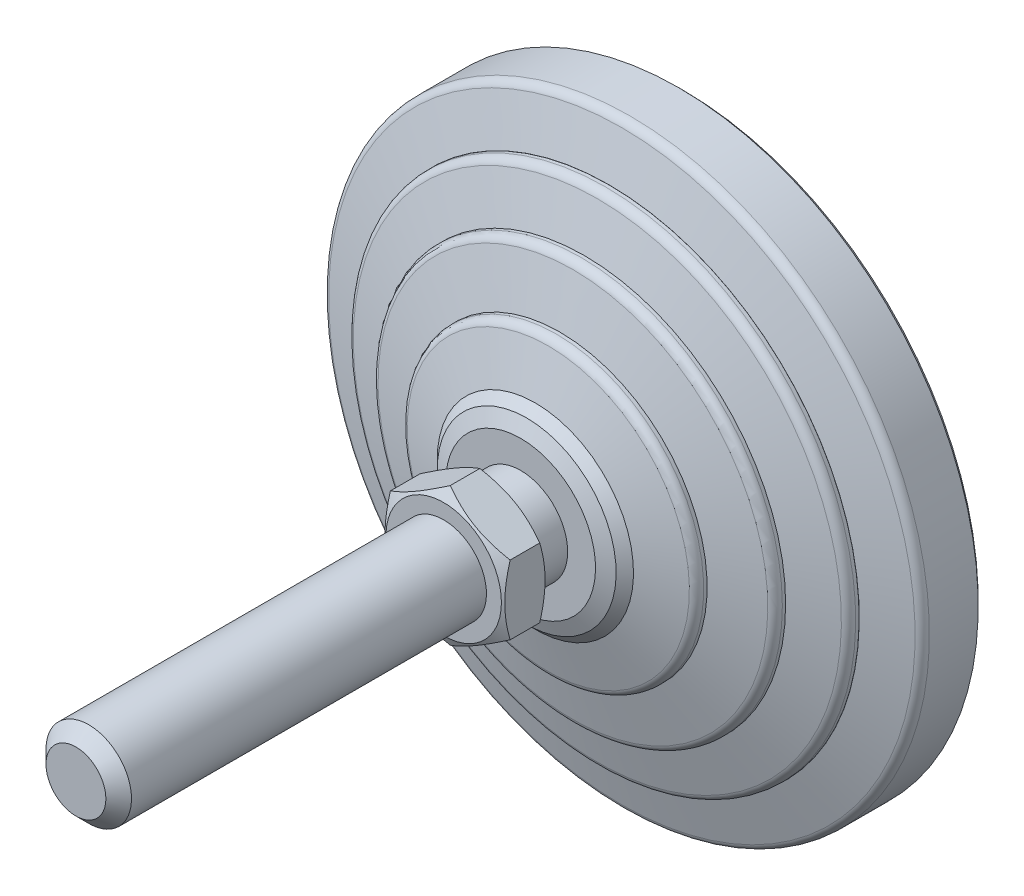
ISO-10303-21;
HEADER;
FILE_DESCRIPTION(('STEP AP214'),'2;1');
FILE_NAME('part.step','',(''),(''),'','','');
FILE_SCHEMA(('AUTOMOTIVE_DESIGN { 1 0 10303 214 1 1 1 1 }'));
ENDSEC;
DATA;
#1=APPLICATION_CONTEXT('core data for automotive mechanical design processes');
#2=APPLICATION_PROTOCOL_DEFINITION('international standard','automotive_design',2000,#1);
#3=PRODUCT_CONTEXT('',#1,'mechanical');
#4=PRODUCT('Part','Part','',(#3));
#5=PRODUCT_RELATED_PRODUCT_CATEGORY('part','',(#4));
#6=PRODUCT_DEFINITION_FORMATION('','',#4);
#7=PRODUCT_DEFINITION_CONTEXT('part definition',#1,'design');
#8=PRODUCT_DEFINITION('design','',#6,#7);
#9=PRODUCT_DEFINITION_SHAPE('','',#8);
#10=(LENGTH_UNIT() NAMED_UNIT(*) SI_UNIT(.MILLI.,.METRE.));
#11=(NAMED_UNIT(*) PLANE_ANGLE_UNIT() SI_UNIT($,.RADIAN.));
#12=(NAMED_UNIT(*) SI_UNIT($,.STERADIAN.) SOLID_ANGLE_UNIT());
#13=UNCERTAINTY_MEASURE_WITH_UNIT(LENGTH_MEASURE(1.E-05),#10,'distance_accuracy_value','');
#14=(GEOMETRIC_REPRESENTATION_CONTEXT(3) GLOBAL_UNCERTAINTY_ASSIGNED_CONTEXT((#13)) GLOBAL_UNIT_ASSIGNED_CONTEXT((#10,
#11,#12)) REPRESENTATION_CONTEXT('',''));
#15=CARTESIAN_POINT('',(0.,0.,0.));
#16=DIRECTION('',(0.,0.,1.));
#17=DIRECTION('',(1.,0.,0.));
#18=AXIS2_PLACEMENT_3D('',#15,#16,#17);
#19=CARTESIAN_POINT('',(-5.5,0.,23.));
#20=DIRECTION('',(0.,0.,1.));
#21=DIRECTION('',(0.,-1.,0.));
#22=AXIS2_PLACEMENT_3D('',#19,#20,#21);
#23=PLANE('',#22);
#24=CARTESIAN_POINT('',(0.,0.,22.9999999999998));
#25=DIRECTION('',(0.,0.,1.));
#26=DIRECTION('',(1.,0.,0.));
#27=AXIS2_PLACEMENT_3D('',#24,#25,#26);
#28=CIRCLE('',#27,6.75);
#29=CARTESIAN_POINT('',(6.75,0.,22.9999999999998));
#30=VERTEX_POINT('',#29);
#31=EDGE_CURVE('E317',#30,#30,#28,.T.);
#32=ORIENTED_EDGE('',*,*,#31,.F.);
#33=EDGE_LOOP('',(#32));
#34=FACE_BOUND('',#33,.T.);
#35=CARTESIAN_POINT('',(0.,0.,23.));
#36=DIRECTION('',(0.,0.,-1.));
#37=DIRECTION('',(0.,1.,0.));
#38=AXIS2_PLACEMENT_3D('',#35,#36,#37);
#39=CIRCLE('',#38,5.5);
#40=CARTESIAN_POINT('',(0.,5.5,23.));
#41=VERTEX_POINT('',#40);
#42=EDGE_CURVE('E156',#41,#41,#39,.T.);
#43=ORIENTED_EDGE('',*,*,#42,.F.);
#44=EDGE_LOOP('',(#43));
#45=FACE_BOUND('',#44,.T.);
#46=ADVANCED_FACE('F14',(#34,#45),#23,.F.);
#47=CARTESIAN_POINT('',(0.,0.,0.));
#48=DIRECTION('',(0.,0.,-1.));
#49=DIRECTION('',(0.,1.,0.));
#50=AXIS2_PLACEMENT_3D('',#47,#48,#49);
#51=CYLINDRICAL_SURFACE('',#50,5.5);
#52=CARTESIAN_POINT('',(0.,0.,19.));
#53=DIRECTION('',(0.,0.,-1.));
#54=DIRECTION('',(0.,1.,0.));
#55=AXIS2_PLACEMENT_3D('',#52,#53,#54);
#56=CIRCLE('',#55,5.5);
#57=CARTESIAN_POINT('',(0.,5.5,19.));
#58=VERTEX_POINT('',#57);
#59=EDGE_CURVE('E153',#58,#58,#56,.T.);
#60=ORIENTED_EDGE('',*,*,#59,.F.);
#61=EDGE_LOOP('',(#60));
#62=FACE_BOUND('',#61,.T.);
#63=ORIENTED_EDGE('',*,*,#42,.T.);
#64=EDGE_LOOP('',(#63));
#65=FACE_BOUND('',#64,.T.);
#66=ADVANCED_FACE('F184',(#62,#65),#51,.T.);
#67=CARTESIAN_POINT('',(-8.75409836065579,0.,19.));
#68=DIRECTION('',(0.,0.,-1.));
#69=DIRECTION('',(0.,1.,0.));
#70=AXIS2_PLACEMENT_3D('',#67,#68,#69);
#71=PLANE('',#70);
#72=CARTESIAN_POINT('',(0.,0.,19.));
#73=DIRECTION('',(0.,0.,-1.));
#74=DIRECTION('',(0.,1.,0.));
#75=AXIS2_PLACEMENT_3D('',#72,#73,#74);
#76=CIRCLE('',#75,8.75409836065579);
#77=CARTESIAN_POINT('',(0.,8.75409836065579,19.));
#78=VERTEX_POINT('',#77);
#79=EDGE_CURVE('E150',#78,#78,#76,.T.);
#80=ORIENTED_EDGE('',*,*,#79,.F.);
#81=EDGE_LOOP('',(#80));
#82=FACE_BOUND('',#81,.T.);
#83=ORIENTED_EDGE('',*,*,#59,.T.);
#84=EDGE_LOOP('',(#83));
#85=FACE_BOUND('',#84,.T.);
#86=ADVANCED_FACE('F191',(#82,#85),#71,.F.);
#87=CARTESIAN_POINT('',(0.,0.,19.));
#88=DIRECTION('',(0.,0.,-1.));
#89=DIRECTION('',(0.,1.,0.));
#90=AXIS2_PLACEMENT_3D('',#87,#88,#89);
#91=CONICAL_SURFACE('',#90,8.75409836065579,1.17809724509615);
#92=CARTESIAN_POINT('',(0.,0.,18.2928932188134));
#93=DIRECTION('',(0.,0.,-1.));
#94=DIRECTION('',(0.,1.,0.));
#95=AXIS2_PLACEMENT_3D('',#92,#93,#94);
#96=CIRCLE('',#95,10.4612051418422);
#97=CARTESIAN_POINT('',(0.,10.4612051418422,18.2928932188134));
#98=VERTEX_POINT('',#97);
#99=EDGE_CURVE('E147',#98,#98,#96,.T.);
#100=ORIENTED_EDGE('',*,*,#99,.F.);
#101=EDGE_LOOP('',(#100));
#102=FACE_BOUND('',#101,.T.);
#103=ORIENTED_EDGE('',*,*,#79,.T.);
#104=EDGE_LOOP('',(#103));
#105=FACE_BOUND('',#104,.T.);
#106=ADVANCED_FACE('F548',(#102,#105),#91,.T.);
#107=CARTESIAN_POINT('',(0.,0.,18.2928932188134));
#108=DIRECTION('',(0.,0.,-1.));
#109=DIRECTION('',(0.,1.,0.));
#110=AXIS2_PLACEMENT_3D('',#107,#108,#109);
#111=CONICAL_SURFACE('',#110,10.4612051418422,0.785398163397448);
#112=CARTESIAN_POINT('',(0.,0.,17.2786885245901));
#113=DIRECTION('',(0.,0.,-1.));
#114=DIRECTION('',(0.,1.,0.));
#115=AXIS2_PLACEMENT_3D('',#112,#113,#114);
#116=CIRCLE('',#115,11.4754098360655);
#117=CARTESIAN_POINT('',(0.,11.4754098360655,17.2786885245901));
#118=VERTEX_POINT('',#117);
#119=EDGE_CURVE('E144',#118,#118,#116,.T.);
#120=ORIENTED_EDGE('',*,*,#119,.F.);
#121=EDGE_LOOP('',(#120));
#122=FACE_BOUND('',#121,.T.);
#123=ORIENTED_EDGE('',*,*,#99,.T.);
#124=EDGE_LOOP('',(#123));
#125=FACE_BOUND('',#124,.T.);
#126=ADVANCED_FACE('F539',(#122,#125),#111,.T.);
#127=CARTESIAN_POINT('',(0.,0.,17.2786885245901));
#128=DIRECTION('',(0.,0.,-1.));
#129=DIRECTION('',(0.,1.,0.));
#130=AXIS2_PLACEMENT_3D('',#127,#128,#129);
#131=CONICAL_SURFACE('',#130,11.4754098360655,1.27933953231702);
#132=CARTESIAN_POINT('',(0.,0.,15.7711726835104));
#133=DIRECTION('',(0.,0.,-1.));
#134=DIRECTION('',(0.,1.,0.));
#135=AXIS2_PLACEMENT_3D('',#132,#133,#134);
#136=CIRCLE('',#135,16.5004626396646);
#137=CARTESIAN_POINT('',(0.,16.5004626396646,15.7711726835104));
#138=VERTEX_POINT('',#137);
#139=EDGE_CURVE('E141',#138,#138,#136,.T.);
#140=ORIENTED_EDGE('',*,*,#139,.F.);
#141=EDGE_LOOP('',(#140));
#142=FACE_BOUND('',#141,.T.);
#143=ORIENTED_EDGE('',*,*,#119,.T.);
#144=EDGE_LOOP('',(#143));
#145=FACE_BOUND('',#144,.T.);
#146=ADVANCED_FACE('F530',(#142,#145),#131,.T.);
#147=CARTESIAN_POINT('',(0.,0.,14.8133463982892));
#148=DIRECTION('',(0.,0.,-1.));
#149=DIRECTION('',(0.,1.,0.));
#150=AXIS2_PLACEMENT_3D('',#147,#148,#149);
#151=TOROIDAL_SURFACE('',#150,16.2131147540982,1.);
#152=CARTESIAN_POINT('',(0.,0.,14.8133463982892));
#153=DIRECTION('',(0.,0.,-1.));
#154=DIRECTION('',(0.,1.,0.));
#155=AXIS2_PLACEMENT_3D('',#152,#153,#154);
#156=CIRCLE('',#155,17.2131147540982);
#157=CARTESIAN_POINT('',(0.,17.2131147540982,14.8133463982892));
#158=VERTEX_POINT('',#157);
#159=EDGE_CURVE('E138',#158,#158,#156,.T.);
#160=ORIENTED_EDGE('',*,*,#159,.F.);
#161=EDGE_LOOP('',(#160));
#162=FACE_BOUND('',#161,.T.);
#163=ORIENTED_EDGE('',*,*,#139,.T.);
#164=EDGE_LOOP('',(#163));
#165=FACE_BOUND('',#164,.T.);
#166=ADVANCED_FACE('F521',(#162,#165),#151,.T.);
#167=CARTESIAN_POINT('',(0.,0.,0.));
#168=DIRECTION('',(0.,0.,-1.));
#169=DIRECTION('',(0.,1.,0.));
#170=AXIS2_PLACEMENT_3D('',#167,#168,#169);
#171=CYLINDRICAL_SURFACE('',#170,17.2131147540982);
#172=CARTESIAN_POINT('',(0.,0.,14.4098360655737));
#173=DIRECTION('',(0.,0.,-1.));
#174=DIRECTION('',(0.,1.,0.));
#175=AXIS2_PLACEMENT_3D('',#172,#173,#174);
#176=CIRCLE('',#175,17.2131147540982);
#177=CARTESIAN_POINT('',(0.,17.2131147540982,14.4098360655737));
#178=VERTEX_POINT('',#177);
#179=EDGE_CURVE('E135',#178,#178,#176,.T.);
#180=ORIENTED_EDGE('',*,*,#179,.F.);
#181=EDGE_LOOP('',(#180));
#182=FACE_BOUND('',#181,.T.);
#183=ORIENTED_EDGE('',*,*,#159,.T.);
#184=EDGE_LOOP('',(#183));
#185=FACE_BOUND('',#184,.T.);
#186=ADVANCED_FACE('F512',(#182,#185),#171,.T.);
#187=CARTESIAN_POINT('',(0.,0.,14.4098360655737));
#188=DIRECTION('',(0.,0.,-1.));
#189=DIRECTION('',(0.,1.,0.));
#190=AXIS2_PLACEMENT_3D('',#187,#188,#189);
#191=CONICAL_SURFACE('',#190,17.2131147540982,1.30454427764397);
#192=CARTESIAN_POINT('',(0.,0.,12.8894925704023));
#193=DIRECTION('',(0.,0.,-1.));
#194=DIRECTION('',(0.,1.,0.));
#195=AXIS2_PLACEMENT_3D('',#192,#193,#194);
#196=CIRCLE('',#195,22.7877075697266);
#197=CARTESIAN_POINT('',(0.,22.7877075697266,12.8894925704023));
#198=VERTEX_POINT('',#197);
#199=EDGE_CURVE('E132',#198,#198,#196,.T.);
#200=ORIENTED_EDGE('',*,*,#199,.F.);
#201=EDGE_LOOP('',(#200));
#202=FACE_BOUND('',#201,.T.);
#203=ORIENTED_EDGE('',*,*,#179,.T.);
#204=EDGE_LOOP('',(#203));
#205=FACE_BOUND('',#204,.T.);
#206=ADVANCED_FACE('F503',(#202,#205),#191,.T.);
#207=CARTESIAN_POINT('',(0.,0.,11.9247287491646));
#208=DIRECTION('',(0.,0.,-1.));
#209=DIRECTION('',(0.,1.,0.));
#210=AXIS2_PLACEMENT_3D('',#207,#208,#209);
#211=TOROIDAL_SURFACE('',#210,22.5245901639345,1.);
#212=CARTESIAN_POINT('',(0.,0.,11.9247287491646));
#213=DIRECTION('',(0.,0.,-1.));
#214=DIRECTION('',(0.,1.,0.));
#215=AXIS2_PLACEMENT_3D('',#212,#213,#214);
#216=CIRCLE('',#215,23.5245901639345);
#217=CARTESIAN_POINT('',(0.,23.5245901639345,11.9247287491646));
#218=VERTEX_POINT('',#217);
#219=EDGE_CURVE('E129',#218,#218,#216,.T.);
#220=ORIENTED_EDGE('',*,*,#219,.F.);
#221=EDGE_LOOP('',(#220));
#222=FACE_BOUND('',#221,.T.);
#223=ORIENTED_EDGE('',*,*,#199,.T.);
#224=EDGE_LOOP('',(#223));
#225=FACE_BOUND('',#224,.T.);
#226=ADVANCED_FACE('F494',(#222,#225),#211,.T.);
#227=CARTESIAN_POINT('',(0.,0.,0.));
#228=DIRECTION('',(0.,0.,-1.));
#229=DIRECTION('',(0.,1.,0.));
#230=AXIS2_PLACEMENT_3D('',#227,#228,#229);
#231=CYLINDRICAL_SURFACE('',#230,23.5245901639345);
#232=CARTESIAN_POINT('',(0.,0.,11.5409836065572));
#233=DIRECTION('',(0.,0.,-1.));
#234=DIRECTION('',(0.,1.,0.));
#235=AXIS2_PLACEMENT_3D('',#232,#233,#234);
#236=CIRCLE('',#235,23.5245901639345);
#237=CARTESIAN_POINT('',(0.,23.5245901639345,11.5409836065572));
#238=VERTEX_POINT('',#237);
#239=EDGE_CURVE('E126',#238,#238,#236,.T.);
#240=ORIENTED_EDGE('',*,*,#239,.F.);
#241=EDGE_LOOP('',(#240));
#242=FACE_BOUND('',#241,.T.);
#243=ORIENTED_EDGE('',*,*,#219,.T.);
#244=EDGE_LOOP('',(#243));
#245=FACE_BOUND('',#244,.T.);
#246=ADVANCED_FACE('F485',(#242,#245),#231,.T.);
#247=CARTESIAN_POINT('',(0.,0.,11.5409836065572));
#248=DIRECTION('',(0.,0.,-1.));
#249=DIRECTION('',(0.,1.,0.));
#250=AXIS2_PLACEMENT_3D('',#247,#248,#249);
#251=CONICAL_SURFACE('',#250,23.5245901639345,1.2787125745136);
#252=CARTESIAN_POINT('',(0.,0.,10.0337743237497));
#253=DIRECTION('',(0.,0.,-1.));
#254=DIRECTION('',(0.,1.,0.));
#255=AXIS2_PLACEMENT_3D('',#252,#253,#254);
#256=CIRCLE('',#255,28.5372004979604);
#257=CARTESIAN_POINT('',(0.,28.5372004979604,10.0337743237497));
#258=VERTEX_POINT('',#257);
#259=EDGE_CURVE('E123',#258,#258,#256,.T.);
#260=ORIENTED_EDGE('',*,*,#259,.F.);
#261=EDGE_LOOP('',(#260));
#262=FACE_BOUND('',#261,.T.);
#263=ORIENTED_EDGE('',*,*,#239,.T.);
#264=EDGE_LOOP('',(#263));
#265=FACE_BOUND('',#264,.T.);
#266=ADVANCED_FACE('F476',(#262,#265),#251,.T.);
#267=CARTESIAN_POINT('',(0.,0.,9.07612838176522));
#268=DIRECTION('',(0.,0.,-1.));
#269=DIRECTION('',(0.,1.,0.));
#270=AXIS2_PLACEMENT_3D('',#267,#268,#269);
#271=TOROIDAL_SURFACE('',#270,28.2492521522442,1.);
#272=CARTESIAN_POINT('',(0.,0.,9.07612838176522));
#273=DIRECTION('',(0.,0.,-1.));
#274=DIRECTION('',(0.,1.,0.));
#275=AXIS2_PLACEMENT_3D('',#272,#273,#274);
#276=CIRCLE('',#275,29.2492521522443);
#277=CARTESIAN_POINT('',(0.,29.2492521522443,9.07612838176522));
#278=VERTEX_POINT('',#277);
#279=EDGE_CURVE('E120',#278,#278,#276,.T.);
#280=ORIENTED_EDGE('',*,*,#279,.F.);
#281=EDGE_LOOP('',(#280));
#282=FACE_BOUND('',#281,.T.);
#283=ORIENTED_EDGE('',*,*,#259,.T.);
#284=EDGE_LOOP('',(#283));
#285=FACE_BOUND('',#284,.T.);
#286=ADVANCED_FACE('F467',(#282,#285),#271,.T.);
#287=CARTESIAN_POINT('',(0.,0.,0.));
#288=DIRECTION('',(0.,0.,-1.));
#289=DIRECTION('',(0.,1.,0.));
#290=AXIS2_PLACEMENT_3D('',#287,#288,#289);
#291=CYLINDRICAL_SURFACE('',#290,29.2492521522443);
#292=CARTESIAN_POINT('',(0.,0.,8.67213114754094));
#293=DIRECTION('',(0.,0.,-1.));
#294=DIRECTION('',(0.,1.,0.));
#295=AXIS2_PLACEMENT_3D('',#292,#293,#294);
#296=CIRCLE('',#295,29.2492521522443);
#297=CARTESIAN_POINT('',(0.,29.2492521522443,8.67213114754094));
#298=VERTEX_POINT('',#297);
#299=EDGE_CURVE('E117',#298,#298,#296,.T.);
#300=ORIENTED_EDGE('',*,*,#299,.F.);
#301=EDGE_LOOP('',(#300));
#302=FACE_BOUND('',#301,.T.);
#303=ORIENTED_EDGE('',*,*,#279,.T.);
#304=EDGE_LOOP('',(#303));
#305=FACE_BOUND('',#304,.T.);
#306=ADVANCED_FACE('F458',(#302,#305),#291,.T.);
#307=CARTESIAN_POINT('',(-29.2622950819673,0.,8.67213114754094));
#308=DIRECTION('',(0.,0.,-1.));
#309=DIRECTION('',(0.,1.,0.));
#310=AXIS2_PLACEMENT_3D('',#307,#308,#309);
#311=PLANE('',#310);
#312=CARTESIAN_POINT('',(0.,0.,8.67213114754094));
#313=DIRECTION('',(0.,0.,-1.));
#314=DIRECTION('',(0.,1.,0.));
#315=AXIS2_PLACEMENT_3D('',#312,#313,#314);
#316=CIRCLE('',#315,29.2622950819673);
#317=CARTESIAN_POINT('',(0.,29.2622950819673,8.67213114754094));
#318=VERTEX_POINT('',#317);
#319=EDGE_CURVE('E114',#318,#318,#316,.T.);
#320=ORIENTED_EDGE('',*,*,#319,.F.);
#321=EDGE_LOOP('',(#320));
#322=FACE_BOUND('',#321,.T.);
#323=ORIENTED_EDGE('',*,*,#299,.T.);
#324=EDGE_LOOP('',(#323));
#325=FACE_BOUND('',#324,.T.);
#326=ADVANCED_FACE('F449',(#322,#325),#311,.F.);
#327=CARTESIAN_POINT('',(0.,0.,8.67213114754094));
#328=DIRECTION('',(0.,0.,-1.));
#329=DIRECTION('',(0.,1.,0.));
#330=AXIS2_PLACEMENT_3D('',#327,#328,#329);
#331=CONICAL_SURFACE('',#330,29.2622950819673,1.27933953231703);
#332=CARTESIAN_POINT('',(0.,0.,7.16461530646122));
#333=DIRECTION('',(0.,0.,-1.));
#334=DIRECTION('',(0.,1.,0.));
#335=AXIS2_PLACEMENT_3D('',#332,#333,#334);
#336=CIRCLE('',#335,34.2873478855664);
#337=CARTESIAN_POINT('',(0.,34.2873478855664,7.16461530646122));
#338=VERTEX_POINT('',#337);
#339=EDGE_CURVE('E111',#338,#338,#336,.T.);
#340=ORIENTED_EDGE('',*,*,#339,.F.);
#341=EDGE_LOOP('',(#340));
#342=FACE_BOUND('',#341,.T.);
#343=ORIENTED_EDGE('',*,*,#319,.T.);
#344=EDGE_LOOP('',(#343));
#345=FACE_BOUND('',#344,.T.);
#346=ADVANCED_FACE('F440',(#342,#345),#331,.T.);
#347=CARTESIAN_POINT('',(0.,0.,6.20678902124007));
#348=DIRECTION('',(0.,0.,-1.));
#349=DIRECTION('',(0.,1.,0.));
#350=AXIS2_PLACEMENT_3D('',#347,#348,#349);
#351=TOROIDAL_SURFACE('',#350,34.,1.);
#352=CARTESIAN_POINT('',(0.,0.,6.20678902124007));
#353=DIRECTION('',(0.,0.,-1.));
#354=DIRECTION('',(0.,1.,0.));
#355=AXIS2_PLACEMENT_3D('',#352,#353,#354);
#356=CIRCLE('',#355,35.);
#357=CARTESIAN_POINT('',(0.,35.,6.20678902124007));
#358=VERTEX_POINT('',#357);
#359=EDGE_CURVE('E108',#358,#358,#356,.T.);
#360=ORIENTED_EDGE('',*,*,#359,.F.);
#361=EDGE_LOOP('',(#360));
#362=FACE_BOUND('',#361,.T.);
#363=ORIENTED_EDGE('',*,*,#339,.T.);
#364=EDGE_LOOP('',(#363));
#365=FACE_BOUND('',#364,.T.);
#366=ADVANCED_FACE('F431',(#362,#365),#351,.T.);
#367=CARTESIAN_POINT('',(0.,0.,0.));
#368=DIRECTION('',(0.,0.,-1.));
#369=DIRECTION('',(0.,1.,0.));
#370=AXIS2_PLACEMENT_3D('',#367,#368,#369);
#371=CYLINDRICAL_SURFACE('',#370,35.);
#372=CARTESIAN_POINT('',(0.,0.,0.5));
#373=DIRECTION('',(0.,0.,-1.));
#374=DIRECTION('',(0.,1.,0.));
#375=AXIS2_PLACEMENT_3D('',#372,#373,#374);
#376=CIRCLE('',#375,35.);
#377=CARTESIAN_POINT('',(0.,35.,0.5));
#378=VERTEX_POINT('',#377);
#379=EDGE_CURVE('E105',#378,#378,#376,.T.);
#380=ORIENTED_EDGE('',*,*,#379,.F.);
#381=EDGE_LOOP('',(#380));
#382=FACE_BOUND('',#381,.T.);
#383=ORIENTED_EDGE('',*,*,#359,.T.);
#384=EDGE_LOOP('',(#383));
#385=FACE_BOUND('',#384,.T.);
#386=ADVANCED_FACE('F422',(#382,#385),#371,.T.);
#387=CARTESIAN_POINT('',(0.,0.,0.5));
#388=DIRECTION('',(0.,0.,1.));
#389=DIRECTION('',(0.,-1.,0.));
#390=AXIS2_PLACEMENT_3D('',#387,#388,#389);
#391=CONICAL_SURFACE('',#390,35.,0.785398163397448);
#392=CARTESIAN_POINT('',(0.,0.,0.));
#393=DIRECTION('',(0.,0.,-1.));
#394=DIRECTION('',(0.,1.,0.));
#395=AXIS2_PLACEMENT_3D('',#392,#393,#394);
#396=CIRCLE('',#395,34.5);
#397=CARTESIAN_POINT('',(0.,34.5,0.));
#398=VERTEX_POINT('',#397);
#399=EDGE_CURVE('E102',#398,#398,#396,.T.);
#400=ORIENTED_EDGE('',*,*,#399,.F.);
#401=EDGE_LOOP('',(#400));
#402=FACE_BOUND('',#401,.T.);
#403=ORIENTED_EDGE('',*,*,#379,.T.);
#404=EDGE_LOOP('',(#403));
#405=FACE_BOUND('',#404,.T.);
#406=ADVANCED_FACE('F415',(#402,#405),#391,.T.);
#407=CARTESIAN_POINT('',(-34.5,0.,0.));
#408=DIRECTION('',(0.,0.,1.));
#409=DIRECTION('',(0.,-1.,0.));
#410=AXIS2_PLACEMENT_3D('',#407,#408,#409);
#411=PLANE('',#410);
#412=ORIENTED_EDGE('',*,*,#399,.T.);
#413=EDGE_LOOP('',(#412));
#414=FACE_BOUND('',#413,.T.);
#415=ADVANCED_FACE('F181',(#414),#411,.F.);
#416=CARTESIAN_POINT('',(0.,0.,22.9999999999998));
#417=DIRECTION('',(0.,0.,1.));
#418=DIRECTION('',(1.,0.,0.));
#419=AXIS2_PLACEMENT_3D('',#416,#417,#418);
#420=CONICAL_SURFACE('',#419,6.75,1.0471975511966);
#421=CARTESIAN_POINT('',(0.000200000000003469,-8.0830192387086,23.7696190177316));
#422=CARTESIAN_POINT('',(-0.153667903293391,-7.99418356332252,23.7183374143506));
#423=CARTESIAN_POINT('',(-0.308109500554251,-7.90501666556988,23.6693831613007));
#424=CARTESIAN_POINT('',(-0.618246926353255,-7.72595873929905,23.5767703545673));
#425=CARTESIAN_POINT('',(-0.773943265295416,-7.63606741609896,23.5331140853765));
#426=CARTESIAN_POINT('',(-1.24352516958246,-7.36495417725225,23.4109491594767));
#427=CARTESIAN_POINT('',(-1.5592643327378,-7.18266208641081,23.3414631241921));
#428=CARTESIAN_POINT('',(-2.03176224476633,-6.90986528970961,23.2599825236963));
#429=CARTESIAN_POINT('',(-2.18710922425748,-6.82017566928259,23.2367710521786));
#430=CARTESIAN_POINT('',(-2.49850511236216,-6.64039116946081,23.1978487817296));
#431=CARTESIAN_POINT('',(-2.65455395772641,-6.55029632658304,23.1821373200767));
#432=CARTESIAN_POINT('',(-2.96692267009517,-6.36995016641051,23.1586154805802));
#433=CARTESIAN_POINT('',(-3.12324202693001,-6.27969914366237,23.15079613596));
#434=CARTESIAN_POINT('',(-3.43601650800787,-6.09911871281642,23.1432178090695));
#435=CARTESIAN_POINT('',(-3.59247162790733,-6.00878930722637,23.1434585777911));
#436=CARTESIAN_POINT('',(-4.02110687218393,-5.76131663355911,23.1551972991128));
#437=CARTESIAN_POINT('',(-4.2931466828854,-5.60425437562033,23.1749033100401));
#438=CARTESIAN_POINT('',(-4.83541944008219,-5.29117305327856,23.2373910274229));
#439=CARTESIAN_POINT('',(-5.10565047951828,-5.13515508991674,23.2801940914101));
#440=CARTESIAN_POINT('',(-5.64901454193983,-4.82144370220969,23.3871892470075));
#441=CARTESIAN_POINT('',(-5.92207900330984,-4.6637898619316,23.4518346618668));
#442=CARTESIAN_POINT('',(-6.46413578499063,-4.35083323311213,23.5985536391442));
#443=CARTESIAN_POINT('',(-6.73313504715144,-4.19552643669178,23.6805927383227));
#444=CARTESIAN_POINT('',(-7.0002,-4.04133641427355,23.7696190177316));
#445=B_SPLINE_CURVE_WITH_KNOTS('',3,(#421,#422,#423,#424,#425,#426,#427,#428,#429,#430,#431,
#432,#433,#434,#435,#436,#437,#438,#439,#440,#441,#442,#443,#444),.UNSPECIFIED.,.F.,.F.,(4,2,2,
2,2,2,2,2,2,2,2,4),(0.,0.554727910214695,1.10969417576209,2.2219327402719,2.76443041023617,
3.30688013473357,3.8487128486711,4.39052882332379,5.33376515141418,6.27787517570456,
7.2429241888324,8.20607866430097),.UNSPECIFIED.);
#446=CARTESIAN_POINT('',(0.,-8.08290376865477,23.7695523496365));
#447=VERTEX_POINT('',#446);
#448=CARTESIAN_POINT('',(-7.,-4.04145188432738,23.7695523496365));
#449=VERTEX_POINT('',#448);
#450=EDGE_CURVE('E73',#447,#449,#445,.T.);
#451=ORIENTED_EDGE('',*,*,#450,.T.);
#452=CARTESIAN_POINT('',(-7.,-10.7972051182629,26.5320991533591));
#453=CARTESIAN_POINT('',(-7.,-10.4919542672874,26.3842618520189));
#454=CARTESIAN_POINT('',(-7.,-10.1859963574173,26.2378591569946));
#455=CARTESIAN_POINT('',(-7.,-9.57229016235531,25.9487310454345));
#456=CARTESIAN_POINT('',(-7.,-9.26454159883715,25.8060062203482));
#457=CARTESIAN_POINT('',(-7.,-8.64526391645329,25.5243112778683));
#458=CARTESIAN_POINT('',(-7.,-8.33372329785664,25.3853663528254));
#459=CARTESIAN_POINT('',(-7.,-7.70814357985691,25.1132415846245));
#460=CARTESIAN_POINT('',(-7.,-7.39410460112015,24.9800614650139));
#461=CARTESIAN_POINT('',(-7.,-6.75312402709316,24.716924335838));
#462=CARTESIAN_POINT('',(-7.,-6.42608663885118,24.5871993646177));
#463=CARTESIAN_POINT('',(-7.,-5.76816495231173,24.3377102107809));
#464=CARTESIAN_POINT('',(-7.,-5.43728022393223,24.2179471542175));
#465=CARTESIAN_POINT('',(-7.,-4.77177194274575,23.9915692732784));
#466=CARTESIAN_POINT('',(-7.,-4.43715772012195,23.8849273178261));
#467=CARTESIAN_POINT('',(-7.,-3.76314225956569,23.6882506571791));
#468=CARTESIAN_POINT('',(-7.,-3.42374258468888,23.5982106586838));
#469=CARTESIAN_POINT('',(-7.,-2.741777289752,23.4395787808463));
#470=CARTESIAN_POINT('',(-7.,-2.39923892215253,23.3708729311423));
#471=CARTESIAN_POINT('',(-7.,-1.88235958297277,23.2868187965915));
#472=CARTESIAN_POINT('',(-7.,-1.70954136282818,23.2619670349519));
#473=CARTESIAN_POINT('',(-7.,-1.36306602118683,23.2190871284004));
#474=CARTESIAN_POINT('',(-7.,-1.18940898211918,23.2010583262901));
#475=CARTESIAN_POINT('',(-7.,-0.843731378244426,23.1724066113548));
#476=CARTESIAN_POINT('',(-7.,-0.671718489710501,23.1616914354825));
#477=CARTESIAN_POINT('',(-7.,-0.327393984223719,23.1475406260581));
#478=CARTESIAN_POINT('',(-7.,-0.155082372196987,23.1441048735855));
#479=CARTESIAN_POINT('',(-7.,0.189532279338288,23.1445947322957));
#480=CARTESIAN_POINT('',(-7.,0.361835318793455,23.1485203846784));
#481=CARTESIAN_POINT('',(-7.,0.706124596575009,23.1636381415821));
#482=CARTESIAN_POINT('',(-7.,0.878110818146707,23.1748306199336));
#483=CARTESIAN_POINT('',(-7.,1.29324007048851,23.2103817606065));
#484=CARTESIAN_POINT('',(-7.,1.53608552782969,23.238287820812));
#485=CARTESIAN_POINT('',(-7.,2.01992385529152,23.3070519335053));
#486=CARTESIAN_POINT('',(-7.,2.26091646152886,23.3479117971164));
#487=CARTESIAN_POINT('',(-7.,2.98086766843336,23.487751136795));
#488=CARTESIAN_POINT('',(-7.,3.45652055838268,23.6039633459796));
#489=CARTESIAN_POINT('',(-7.,4.16767313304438,23.8048526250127));
#490=CARTESIAN_POINT('',(-7.,4.40687729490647,23.8771645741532));
#491=CARTESIAN_POINT('',(-7.,4.88296125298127,24.0291411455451));
#492=CARTESIAN_POINT('',(-7.,5.1198410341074,24.1088058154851));
#493=CARTESIAN_POINT('',(-7.,5.59135382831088,24.2742227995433));
#494=CARTESIAN_POINT('',(-7.,5.8259875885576,24.3599730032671));
#495=CARTESIAN_POINT('',(-7.,6.2933217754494,24.5365678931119));
#496=CARTESIAN_POINT('',(-7.,6.5260222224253,24.6274125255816));
#497=CARTESIAN_POINT('',(-7.,7.06555458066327,24.8437623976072));
#498=CARTESIAN_POINT('',(-7.,7.3717366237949,24.97088505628));
#499=CARTESIAN_POINT('',(-7.,7.98157964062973,25.2310568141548));
#500=CARTESIAN_POINT('',(-7.,8.28524047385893,25.3641062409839));
#501=CARTESIAN_POINT('',(-7.,8.89049234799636,25.6349680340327));
#502=CARTESIAN_POINT('',(-7.,9.19208299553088,25.7727812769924));
#503=CARTESIAN_POINT('',(-7.,9.79348689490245,26.0522395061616));
#504=CARTESIAN_POINT('',(-7.,10.0933001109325,26.1938845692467));
#505=CARTESIAN_POINT('',(-7.,10.69172777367,26.4804433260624));
#506=CARTESIAN_POINT('',(-7.,10.9903407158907,26.6253601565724));
#507=CARTESIAN_POINT('',(-7.,11.586298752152,26.9177800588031));
#508=CARTESIAN_POINT('',(-7.,11.8836438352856,27.0652831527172));
#509=CARTESIAN_POINT('',(-7.,12.7740011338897,27.5109614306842));
#510=CARTESIAN_POINT('',(-7.,13.365409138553,27.8123412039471));
#511=CARTESIAN_POINT('',(-7.,14.4972357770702,28.3964526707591));
#512=CARTESIAN_POINT('',(-7.,15.037898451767,28.6787135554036));
#513=CARTESIAN_POINT('',(-7.,16.1172074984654,29.24710367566));
#514=CARTESIAN_POINT('',(-7.,16.655853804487,29.5332330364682));
#515=CARTESIAN_POINT('',(-7.,17.7302998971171,30.1077707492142));
#516=CARTESIAN_POINT('',(-7.,18.2661033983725,30.3961721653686));
#517=CARTESIAN_POINT('',(-7.,19.3364155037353,30.9753024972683));
#518=CARTESIAN_POINT('',(-7.,19.8709241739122,31.2660312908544));
#519=CARTESIAN_POINT('',(-7.,20.4049534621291,31.557632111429));
#520=B_SPLINE_CURVE_WITH_KNOTS('',3,(#452,#453,#454,#455,#456,#457,#458,#459,#460,#461,#462,
#463,#464,#465,#466,#467,#468,#469,#470,#471,#472,#473,#474,#475,#476,#477,#478,#479,#480,#481,
#482,#483,#484,#485,#486,#487,#488,#489,#490,#491,#492,#493,#494,#495,#496,#497,#498,#499,#500,
#501,#502,#503,#504,#505,#506,#507,#508,#509,#510,#511,#512,#513,#514,#515,#516,#517,#518,#519),
.UNSPECIFIED.,.F.,.F.,(4,2,2,2,2,2,2,2,2,2,2,2,2,2,2,2,2,2,2,2,2,2,2,2,2,2,2,2,2,2,2,2,2,4),(0.,
1.01751236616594,2.03518735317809,3.05850232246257,4.08176816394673,5.13712235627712,
6.19259567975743,7.24584850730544,8.29876493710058,9.34595570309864,9.8696300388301,
10.3932539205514,10.9101436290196,11.4270248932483,11.9439090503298,12.4608197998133,
13.1937351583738,13.9267530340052,15.3936262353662,16.1432515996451,16.8928818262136,
17.6422533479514,18.3916169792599,19.3861034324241,20.380644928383,21.3753704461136,
22.3701159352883,23.3658594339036,24.361611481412,26.352869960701,28.1825761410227,
30.0123416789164,31.8378072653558,33.6631776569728),.UNSPECIFIED.);
#521=CARTESIAN_POINT('',(-7.,4.04145188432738,23.7695523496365));
#522=VERTEX_POINT('',#521);
#523=EDGE_CURVE('E81',#449,#522,#520,.T.);
#524=ORIENTED_EDGE('',*,*,#523,.T.);
#525=CARTESIAN_POINT('',(-7.0002,4.04133641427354,23.7696190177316));
#526=CARTESIAN_POINT('',(-6.84633209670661,4.13017208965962,23.7183374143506));
#527=CARTESIAN_POINT('',(-6.69189049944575,4.21933898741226,23.6693831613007));
#528=CARTESIAN_POINT('',(-6.38175307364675,4.39839691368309,23.5767703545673));
#529=CARTESIAN_POINT('',(-6.22605673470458,4.48828823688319,23.5331140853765));
#530=CARTESIAN_POINT('',(-5.75647483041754,4.75940147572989,23.4109491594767));
#531=CARTESIAN_POINT('',(-5.4407356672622,4.94169356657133,23.3414631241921));
#532=CARTESIAN_POINT('',(-4.96823775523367,5.21449036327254,23.2599825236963));
#533=CARTESIAN_POINT('',(-4.81289077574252,5.30417998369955,23.2367710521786));
#534=CARTESIAN_POINT('',(-4.50149488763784,5.48396448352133,23.1978487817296));
#535=CARTESIAN_POINT('',(-4.34544604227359,5.57405932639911,23.1821373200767));
#536=CARTESIAN_POINT('',(-4.03307732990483,5.75440548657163,23.1586154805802));
#537=CARTESIAN_POINT('',(-3.87675797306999,5.84465650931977,23.15079613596));
#538=CARTESIAN_POINT('',(-3.56398349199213,6.02523694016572,23.1432178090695));
#539=CARTESIAN_POINT('',(-3.40752837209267,6.11556634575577,23.1434585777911));
#540=CARTESIAN_POINT('',(-2.97889312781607,6.36303901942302,23.1551972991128));
#541=CARTESIAN_POINT('',(-2.7068533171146,6.52010127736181,23.1749033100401));
#542=CARTESIAN_POINT('',(-2.16458055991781,6.83318259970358,23.2373910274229));
#543=CARTESIAN_POINT('',(-1.89434952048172,6.9892005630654,23.2801940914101));
#544=CARTESIAN_POINT('',(-1.35098545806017,7.30291195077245,23.3871892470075));
#545=CARTESIAN_POINT('',(-1.07792099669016,7.46056579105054,23.4518346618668));
#546=CARTESIAN_POINT('',(-0.535864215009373,7.77352241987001,23.5985536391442));
#547=CARTESIAN_POINT('',(-0.266864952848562,7.92882921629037,23.6805927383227));
#548=CARTESIAN_POINT('',(0.000199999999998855,8.0830192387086,23.7696190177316));
#549=B_SPLINE_CURVE_WITH_KNOTS('',3,(#525,#526,#527,#528,#529,#530,#531,#532,#533,#534,#535,
#536,#537,#538,#539,#540,#541,#542,#543,#544,#545,#546,#547,#548),.UNSPECIFIED.,.F.,.F.,(4,2,2,
2,2,2,2,2,2,2,2,4),(0.,0.554727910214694,1.10969417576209,2.2219327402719,2.76443041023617,
3.30688013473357,3.84871284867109,4.39052882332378,5.33376515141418,6.27787517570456,
7.2429241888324,8.20607866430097),.UNSPECIFIED.);
#550=CARTESIAN_POINT('',(0.,8.08290376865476,23.7695523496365));
#551=VERTEX_POINT('',#550);
#552=EDGE_CURVE('E284',#522,#551,#549,.T.);
#553=ORIENTED_EDGE('',*,*,#552,.T.);
#554=CARTESIAN_POINT('',(-0.000200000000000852,8.0830192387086,23.7696190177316));
#555=CARTESIAN_POINT('',(0.153667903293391,7.99418356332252,23.7183374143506));
#556=CARTESIAN_POINT('',(0.308109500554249,7.90501666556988,23.6693831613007));
#557=CARTESIAN_POINT('',(0.618246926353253,7.72595873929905,23.5767703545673));
#558=CARTESIAN_POINT('',(0.773943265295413,7.63606741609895,23.5331140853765));
#559=CARTESIAN_POINT('',(1.24352516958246,7.36495417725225,23.4109491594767));
#560=CARTESIAN_POINT('',(1.5592643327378,7.18266208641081,23.3414631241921));
#561=CARTESIAN_POINT('',(2.03176224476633,6.9098652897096,23.2599825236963));
#562=CARTESIAN_POINT('',(2.18710922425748,6.82017566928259,23.2367710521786));
#563=CARTESIAN_POINT('',(2.49850511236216,6.64039116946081,23.1978487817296));
#564=CARTESIAN_POINT('',(2.6545539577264,6.55029632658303,23.1821373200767));
#565=CARTESIAN_POINT('',(2.96692267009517,6.36995016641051,23.1586154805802));
#566=CARTESIAN_POINT('',(3.12324202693,6.27969914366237,23.15079613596));
#567=CARTESIAN_POINT('',(3.43601650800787,6.09911871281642,23.1432178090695));
#568=CARTESIAN_POINT('',(3.59247162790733,6.00878930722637,23.1434585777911));
#569=CARTESIAN_POINT('',(4.02110687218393,5.76131663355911,23.1551972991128));
#570=CARTESIAN_POINT('',(4.29314668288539,5.60425437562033,23.1749033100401));
#571=CARTESIAN_POINT('',(4.83541944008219,5.29117305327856,23.2373910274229));
#572=CARTESIAN_POINT('',(5.10565047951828,5.13515508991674,23.2801940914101));
#573=CARTESIAN_POINT('',(5.64901454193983,4.82144370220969,23.3871892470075));
#574=CARTESIAN_POINT('',(5.92207900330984,4.66378986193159,23.4518346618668));
#575=CARTESIAN_POINT('',(6.46413578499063,4.35083323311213,23.5985536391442));
#576=CARTESIAN_POINT('',(6.73313504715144,4.19552643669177,23.6805927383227));
#577=CARTESIAN_POINT('',(7.0002,4.04133641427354,23.7696190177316));
#578=B_SPLINE_CURVE_WITH_KNOTS('',3,(#554,#555,#556,#557,#558,#559,#560,#561,#562,#563,#564,
#565,#566,#567,#568,#569,#570,#571,#572,#573,#574,#575,#576,#577),.UNSPECIFIED.,.F.,.F.,(4,2,2,
2,2,2,2,2,2,2,2,4),(0.,0.554727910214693,1.10969417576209,2.22193274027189,2.76443041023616,
3.30688013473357,3.84871284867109,4.39052882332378,5.33376515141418,6.27787517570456,
7.2429241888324,8.20607866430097),.UNSPECIFIED.);
#579=CARTESIAN_POINT('',(7.,4.04145188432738,23.7695523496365));
#580=VERTEX_POINT('',#579);
#581=EDGE_CURVE('E285',#551,#580,#578,.T.);
#582=ORIENTED_EDGE('',*,*,#581,.T.);
#583=CARTESIAN_POINT('',(7.,-10.7972051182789,26.5320991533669));
#584=CARTESIAN_POINT('',(7.,-10.4919542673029,26.3842618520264));
#585=CARTESIAN_POINT('',(7.,-10.1859963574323,26.2378591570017));
#586=CARTESIAN_POINT('',(7.,-9.57229016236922,25.948731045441));
#587=CARTESIAN_POINT('',(7.,-9.26454159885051,25.8060062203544));
#588=CARTESIAN_POINT('',(7.,-8.64526391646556,25.5243112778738));
#589=CARTESIAN_POINT('',(7.,-8.33372329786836,25.3853663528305));
#590=CARTESIAN_POINT('',(7.,-7.70814357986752,25.113241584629));
#591=CARTESIAN_POINT('',(7.,-7.3941046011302,24.9800614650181));
#592=CARTESIAN_POINT('',(7.,-6.75312402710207,24.7169243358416));
#593=CARTESIAN_POINT('',(7.,-6.42608663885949,24.5871993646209));
#594=CARTESIAN_POINT('',(7.,-5.76816495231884,24.3377102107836));
#595=CARTESIAN_POINT('',(7.,-5.43728022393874,24.2179471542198));
#596=CARTESIAN_POINT('',(7.,-4.77177194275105,23.9915692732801));
#597=CARTESIAN_POINT('',(7.,-4.43715772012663,23.8849273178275));
#598=CARTESIAN_POINT('',(7.,-3.76314225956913,23.68825065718));
#599=CARTESIAN_POINT('',(7.,-3.42374258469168,23.5982106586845));
#600=CARTESIAN_POINT('',(7.,-2.74177728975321,23.4395787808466));
#601=CARTESIAN_POINT('',(7.,-2.39923892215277,23.3708729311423));
#602=CARTESIAN_POINT('',(7.,-1.88235958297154,23.2868187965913));
#603=CARTESIAN_POINT('',(7.,-1.70954136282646,23.2619670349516));
#604=CARTESIAN_POINT('',(7.,-1.36306602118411,23.2190871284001));
#605=CARTESIAN_POINT('',(7.,-1.18940898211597,23.2010583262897));
#606=CARTESIAN_POINT('',(7.,-0.843731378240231,23.1724066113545));
#607=CARTESIAN_POINT('',(7.,-0.67171848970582,23.1616914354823));
#608=CARTESIAN_POINT('',(7.,-0.327393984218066,23.1475406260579));
#609=CARTESIAN_POINT('',(7.,-0.155082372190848,23.1441048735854));
#610=CARTESIAN_POINT('',(7.,0.189532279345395,23.1445947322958));
#611=CARTESIAN_POINT('',(7.,0.361835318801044,23.1485203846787));
#612=CARTESIAN_POINT('',(7.,0.706124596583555,23.1636381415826));
#613=CARTESIAN_POINT('',(7.,0.878110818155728,23.1748306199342));
#614=CARTESIAN_POINT('',(7.,1.29324007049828,23.2103817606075));
#615=CARTESIAN_POINT('',(7.,1.53608552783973,23.2382878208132));
#616=CARTESIAN_POINT('',(7.,2.01992385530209,23.307051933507));
#617=CARTESIAN_POINT('',(7.,2.26091646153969,23.3479117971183));
#618=CARTESIAN_POINT('',(7.,2.98086766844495,23.4877511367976));
#619=CARTESIAN_POINT('',(7.,3.45652055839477,23.6039633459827));
#620=CARTESIAN_POINT('',(7.,4.1676731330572,23.8048526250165));
#621=CARTESIAN_POINT('',(7.,4.40687729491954,23.8771645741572));
#622=CARTESIAN_POINT('',(7.,4.88296125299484,24.0291411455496));
#623=CARTESIAN_POINT('',(7.,5.11984103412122,24.1088058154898));
#624=CARTESIAN_POINT('',(7.,5.59135382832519,24.2742227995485));
#625=CARTESIAN_POINT('',(7.,5.82598758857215,24.3599730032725));
#626=CARTESIAN_POINT('',(7.,6.29332177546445,24.5365678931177));
#627=CARTESIAN_POINT('',(7.,6.5260222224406,24.6274125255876));
#628=CARTESIAN_POINT('',(7.,7.06555458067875,24.8437623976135));
#629=CARTESIAN_POINT('',(7.,7.3717366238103,24.9708850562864));
#630=CARTESIAN_POINT('',(7.,7.981579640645,25.2310568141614));
#631=CARTESIAN_POINT('',(7.,8.28524047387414,25.3641062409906));
#632=CARTESIAN_POINT('',(7.,8.89049234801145,25.6349680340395));
#633=CARTESIAN_POINT('',(7.,9.19208299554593,25.7727812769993));
#634=CARTESIAN_POINT('',(7.,9.79348689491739,26.0522395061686));
#635=CARTESIAN_POINT('',(7.,10.0933001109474,26.1938845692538));
#636=CARTESIAN_POINT('',(7.,10.6917277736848,26.4804433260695));
#637=CARTESIAN_POINT('',(7.,10.9903407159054,26.6253601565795));
#638=CARTESIAN_POINT('',(7.,11.5862987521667,26.9177800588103));
#639=CARTESIAN_POINT('',(7.,11.8836438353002,27.0652831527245));
#640=CARTESIAN_POINT('',(7.,12.7740011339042,27.5109614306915));
#641=CARTESIAN_POINT('',(7.,13.3654091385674,27.8123412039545));
#642=CARTESIAN_POINT('',(7.,14.4972357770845,28.3964526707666));
#643=CARTESIAN_POINT('',(7.,15.0378984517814,28.6787135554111));
#644=CARTESIAN_POINT('',(7.,16.1172074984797,29.2471036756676));
#645=CARTESIAN_POINT('',(7.,16.6558538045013,29.5332330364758));
#646=CARTESIAN_POINT('',(7.,17.7302998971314,30.1077707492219));
#647=CARTESIAN_POINT('',(7.,18.2661033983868,30.3961721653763));
#648=CARTESIAN_POINT('',(7.,19.3364155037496,30.9753024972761));
#649=CARTESIAN_POINT('',(7.,19.8709241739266,31.2660312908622));
#650=CARTESIAN_POINT('',(7.,20.4049534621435,31.5576321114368));
#651=B_SPLINE_CURVE_WITH_KNOTS('',3,(#583,#584,#585,#586,#587,#588,#589,#590,#591,#592,#593,
#594,#595,#596,#597,#598,#599,#600,#601,#602,#603,#604,#605,#606,#607,#608,#609,#610,#611,#612,
#613,#614,#615,#616,#617,#618,#619,#620,#621,#622,#623,#624,#625,#626,#627,#628,#629,#630,#631,
#632,#633,#634,#635,#636,#637,#638,#639,#640,#641,#642,#643,#644,#645,#646,#647,#648,#649,#650),
.UNSPECIFIED.,.F.,.F.,(4,2,2,2,2,2,2,2,2,2,2,2,2,2,2,2,2,2,2,2,2,2,2,2,2,2,2,2,2,2,2,2,2,4),(0.,
1.01751236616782,2.03518735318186,3.05850232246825,4.08176816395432,5.13712235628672,
6.19259567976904,7.24584850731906,8.29876493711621,9.34595570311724,9.86963003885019,
10.3932539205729,10.9101436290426,11.4270248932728,11.9439090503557,12.4608197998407,
13.193735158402,13.9267530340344,15.3936262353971,16.143251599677,16.8928818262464,
17.642253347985,18.3916169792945,19.3861034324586,20.3806449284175,21.375370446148,
22.3701159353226,23.3658594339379,24.3616114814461,26.352869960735,28.1825761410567,
30.0123416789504,31.83780726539,33.663177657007),.UNSPECIFIED.);
#652=CARTESIAN_POINT('',(7.,-4.04145188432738,23.7695523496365));
#653=VERTEX_POINT('',#652);
#654=EDGE_CURVE('E34',#580,#653,#651,.F.);
#655=ORIENTED_EDGE('',*,*,#654,.T.);
#656=CARTESIAN_POINT('',(7.0002,-4.04133641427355,23.7696190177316));
#657=CARTESIAN_POINT('',(6.84633209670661,-4.13017208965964,23.7183374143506));
#658=CARTESIAN_POINT('',(6.69189049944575,-4.21933898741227,23.6693831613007));
#659=CARTESIAN_POINT('',(6.38175307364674,-4.3983969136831,23.5767703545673));
#660=CARTESIAN_POINT('',(6.22605673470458,-4.4882882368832,23.5331140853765));
#661=CARTESIAN_POINT('',(5.75647483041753,-4.7594014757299,23.4109491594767));
#662=CARTESIAN_POINT('',(5.4407356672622,-4.94169356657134,23.3414631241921));
#663=CARTESIAN_POINT('',(4.96823775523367,-5.21449036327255,23.2599825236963));
#664=CARTESIAN_POINT('',(4.81289077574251,-5.30417998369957,23.2367710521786));
#665=CARTESIAN_POINT('',(4.50149488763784,-5.48396448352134,23.1978487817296));
#666=CARTESIAN_POINT('',(4.34544604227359,-5.57405932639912,23.1821373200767));
#667=CARTESIAN_POINT('',(4.03307732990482,-5.75440548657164,23.1586154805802));
#668=CARTESIAN_POINT('',(3.87675797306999,-5.84465650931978,23.15079613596));
#669=CARTESIAN_POINT('',(3.56398349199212,-6.02523694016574,23.1432178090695));
#670=CARTESIAN_POINT('',(3.40752837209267,-6.11556634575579,23.1434585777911));
#671=CARTESIAN_POINT('',(2.97889312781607,-6.36303901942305,23.1551972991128));
#672=CARTESIAN_POINT('',(2.7068533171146,-6.52010127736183,23.1749033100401));
#673=CARTESIAN_POINT('',(2.1645805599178,-6.83318259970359,23.2373910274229));
#674=CARTESIAN_POINT('',(1.89434952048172,-6.98920056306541,23.2801940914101));
#675=CARTESIAN_POINT('',(1.35098545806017,-7.30291195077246,23.3871892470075));
#676=CARTESIAN_POINT('',(1.07792099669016,-7.46056579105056,23.4518346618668));
#677=CARTESIAN_POINT('',(0.535864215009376,-7.77352241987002,23.5985536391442));
#678=CARTESIAN_POINT('',(0.266864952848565,-7.92882921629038,23.6805927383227));
#679=CARTESIAN_POINT('',(-0.000199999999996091,-8.08301923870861,23.7696190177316));
#680=B_SPLINE_CURVE_WITH_KNOTS('',3,(#656,#657,#658,#659,#660,#661,#662,#663,#664,#665,#666,
#667,#668,#669,#670,#671,#672,#673,#674,#675,#676,#677,#678,#679),.UNSPECIFIED.,.F.,.F.,(4,2,2,
2,2,2,2,2,2,2,2,4),(0.,0.554727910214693,1.10969417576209,2.2219327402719,2.76443041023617,
3.30688013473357,3.8487128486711,4.39052882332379,5.33376515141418,6.27787517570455,
7.24292418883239,8.20607866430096),.UNSPECIFIED.);
#681=EDGE_CURVE('E9',#653,#447,#680,.T.);
#682=ORIENTED_EDGE('',*,*,#681,.T.);
#683=EDGE_LOOP('',(#451,#524,#553,#582,#655,#682));
#684=FACE_BOUND('',#683,.T.);
#685=ORIENTED_EDGE('',*,*,#31,.T.);
#686=EDGE_LOOP('',(#685));
#687=FACE_BOUND('',#686,.T.);
#688=ADVANCED_FACE('F71',(#684,#687),#420,.T.);
#689=CARTESIAN_POINT('',(-3.49999999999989,0.,71.));
#690=DIRECTION('',(0.,0.,-1.));
#691=DIRECTION('',(0.,1.,0.));
#692=AXIS2_PLACEMENT_3D('',#689,#690,#691);
#693=PLANE('',#692);
#694=CARTESIAN_POINT('',(0.,0.,71.));
#695=DIRECTION('',(0.,0.,-1.));
#696=DIRECTION('',(0.,1.,0.));
#697=AXIS2_PLACEMENT_3D('',#694,#695,#696);
#698=CIRCLE('',#697,3.49999999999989);
#699=CARTESIAN_POINT('',(0.,3.49999999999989,71.));
#700=VERTEX_POINT('',#699);
#701=EDGE_CURVE('E99',#700,#700,#698,.T.);
#702=ORIENTED_EDGE('',*,*,#701,.F.);
#703=EDGE_LOOP('',(#702));
#704=FACE_BOUND('',#703,.T.);
#705=ADVANCED_FACE('F170',(#704),#693,.F.);
#706=CARTESIAN_POINT('',(0.,0.,71.));
#707=DIRECTION('',(0.,0.,-1.));
#708=DIRECTION('',(0.,1.,0.));
#709=AXIS2_PLACEMENT_3D('',#706,#707,#708);
#710=CONICAL_SURFACE('',#709,3.49999999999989,0.785398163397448);
#711=CARTESIAN_POINT('',(0.,0.,69.5));
#712=DIRECTION('',(0.,0.,-1.));
#713=DIRECTION('',(0.,1.,0.));
#714=AXIS2_PLACEMENT_3D('',#711,#712,#713);
#715=CIRCLE('',#714,4.99999999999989);
#716=CARTESIAN_POINT('',(0.,4.99999999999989,69.5));
#717=VERTEX_POINT('',#716);
#718=EDGE_CURVE('E96',#717,#717,#715,.T.);
#719=ORIENTED_EDGE('',*,*,#718,.F.);
#720=EDGE_LOOP('',(#719));
#721=FACE_BOUND('',#720,.T.);
#722=ORIENTED_EDGE('',*,*,#701,.T.);
#723=EDGE_LOOP('',(#722));
#724=FACE_BOUND('',#723,.T.);
#725=ADVANCED_FACE('F165',(#721,#724),#710,.T.);
#726=CARTESIAN_POINT('',(0.,0.,0.));
#727=DIRECTION('',(0.,0.,-1.));
#728=DIRECTION('',(0.,1.,0.));
#729=AXIS2_PLACEMENT_3D('',#726,#727,#728);
#730=CYLINDRICAL_SURFACE('',#729,4.99999999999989);
#731=CARTESIAN_POINT('',(0.,0.,28.));
#732=DIRECTION('',(0.,0.,-1.));
#733=DIRECTION('',(0.,1.,0.));
#734=AXIS2_PLACEMENT_3D('',#731,#732,#733);
#735=CIRCLE('',#734,4.99999999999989);
#736=CARTESIAN_POINT('',(0.,4.99999999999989,28.));
#737=VERTEX_POINT('',#736);
#738=EDGE_CURVE('E28',#737,#737,#735,.T.);
#739=ORIENTED_EDGE('',*,*,#738,.F.);
#740=EDGE_LOOP('',(#739));
#741=FACE_BOUND('',#740,.T.);
#742=ORIENTED_EDGE('',*,*,#718,.T.);
#743=EDGE_LOOP('',(#742));
#744=FACE_BOUND('',#743,.T.);
#745=ADVANCED_FACE('F16',(#741,#744),#730,.T.);
#746=CARTESIAN_POINT('',(-4.99999999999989,0.,28.));
#747=DIRECTION('',(0.,0.,-1.));
#748=DIRECTION('',(0.,1.,0.));
#749=AXIS2_PLACEMENT_3D('',#746,#747,#748);
#750=PLANE('',#749);
#751=CARTESIAN_POINT('',(0.,0.,28.));
#752=DIRECTION('',(0.,0.,1.));
#753=DIRECTION('',(1.,0.,0.));
#754=AXIS2_PLACEMENT_3D('',#751,#752,#753);
#755=CIRCLE('',#754,6.75);
#756=CARTESIAN_POINT('',(6.75,0.,28.));
#757=VERTEX_POINT('',#756);
#758=EDGE_CURVE('E80',#757,#757,#755,.T.);
#759=ORIENTED_EDGE('',*,*,#758,.T.);
#760=EDGE_LOOP('',(#759));
#761=FACE_BOUND('',#760,.T.);
#762=ORIENTED_EDGE('',*,*,#738,.T.);
#763=EDGE_LOOP('',(#762));
#764=FACE_BOUND('',#763,.T.);
#765=ADVANCED_FACE('F161',(#761,#764),#750,.F.);
#766=CARTESIAN_POINT('',(0.,0.,26.5202932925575));
#767=DIRECTION('',(0.,0.,-1.));
#768=DIRECTION('',(-1.,0.,0.));
#769=AXIS2_PLACEMENT_3D('',#766,#767,#768);
#770=CONICAL_SURFACE('',#769,9.31292719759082,1.0471975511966);
#771=CARTESIAN_POINT('',(-7.0002,-4.04133641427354,27.2303809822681));
#772=CARTESIAN_POINT('',(-6.84633209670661,-4.13017208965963,27.2816625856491));
#773=CARTESIAN_POINT('',(-6.69189049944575,-4.21933898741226,27.330616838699));
#774=CARTESIAN_POINT('',(-6.38175307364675,-4.39839691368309,27.4232296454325));
#775=CARTESIAN_POINT('',(-6.22605673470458,-4.48828823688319,27.4668859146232));
#776=CARTESIAN_POINT('',(-5.75647483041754,-4.7594014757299,27.5890508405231));
#777=CARTESIAN_POINT('',(-5.4407356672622,-4.94169356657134,27.6585368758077));
#778=CARTESIAN_POINT('',(-4.96823775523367,-5.21449036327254,27.7400174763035));
#779=CARTESIAN_POINT('',(-4.81289077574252,-5.30417998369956,27.7632289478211));
#780=CARTESIAN_POINT('',(-4.50149488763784,-5.48396448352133,27.8021512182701));
#781=CARTESIAN_POINT('',(-4.34544604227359,-5.57405932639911,27.8178626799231));
#782=CARTESIAN_POINT('',(-4.03307732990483,-5.75440548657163,27.8413845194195));
#783=CARTESIAN_POINT('',(-3.87675797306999,-5.84465650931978,27.8492038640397));
#784=CARTESIAN_POINT('',(-3.56398349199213,-6.02523694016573,27.8567821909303));
#785=CARTESIAN_POINT('',(-3.40752837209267,-6.11556634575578,27.8565414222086));
#786=CARTESIAN_POINT('',(-2.97889312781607,-6.36303901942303,27.844802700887));
#787=CARTESIAN_POINT('',(-2.7068533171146,-6.52010127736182,27.8250966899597));
#788=CARTESIAN_POINT('',(-2.1645805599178,-6.83318259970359,27.7626089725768));
#789=CARTESIAN_POINT('',(-1.89434952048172,-6.98920056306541,27.7198059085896));
#790=CARTESIAN_POINT('',(-1.35098545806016,-7.30291195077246,27.6128107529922));
#791=CARTESIAN_POINT('',(-1.07792099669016,-7.46056579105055,27.5481653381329));
#792=CARTESIAN_POINT('',(-0.535864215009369,-7.77352241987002,27.4014463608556));
#793=CARTESIAN_POINT('',(-0.266864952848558,-7.92882921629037,27.319407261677));
#794=CARTESIAN_POINT('',(0.000200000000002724,-8.0830192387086,27.2303809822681));
#795=B_SPLINE_CURVE_WITH_KNOTS('',3,(#771,#772,#773,#774,#775,#776,#777,#778,#779,#780,#781,
#782,#783,#784,#785,#786,#787,#788,#789,#790,#791,#792,#793,#794),.UNSPECIFIED.,.F.,.F.,(4,2,2,
2,2,2,2,2,2,2,2,4),(0.,0.554727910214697,1.10969417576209,2.2219327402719,2.76443041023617,
3.30688013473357,3.8487128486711,4.39052882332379,5.33376515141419,6.27787517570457,
7.2429241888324,8.20607866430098),.UNSPECIFIED.);
#796=CARTESIAN_POINT('',(-7.,-4.04145188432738,27.2304476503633));
#797=VERTEX_POINT('',#796);
#798=CARTESIAN_POINT('',(0.,-8.08290376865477,27.2304476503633));
#799=VERTEX_POINT('',#798);
#800=EDGE_CURVE('E88',#797,#799,#795,.T.);
#801=ORIENTED_EDGE('',*,*,#800,.T.);
#802=CARTESIAN_POINT('',(-0.000199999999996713,-8.08301923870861,27.2303809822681));
#803=CARTESIAN_POINT('',(0.153667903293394,-7.99418356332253,27.2816625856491));
#804=CARTESIAN_POINT('',(0.308109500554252,-7.90501666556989,27.330616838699));
#805=CARTESIAN_POINT('',(0.618246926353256,-7.72595873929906,27.4232296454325));
#806=CARTESIAN_POINT('',(0.773943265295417,-7.63606741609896,27.4668859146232));
#807=CARTESIAN_POINT('',(1.24352516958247,-7.36495417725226,27.5890508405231));
#808=CARTESIAN_POINT('',(1.5592643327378,-7.18266208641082,27.6585368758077));
#809=CARTESIAN_POINT('',(2.03176224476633,-6.90986528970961,27.7400174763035));
#810=CARTESIAN_POINT('',(2.18710922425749,-6.8201756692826,27.7632289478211));
#811=CARTESIAN_POINT('',(2.49850511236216,-6.64039116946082,27.8021512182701));
#812=CARTESIAN_POINT('',(2.65455395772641,-6.55029632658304,27.8178626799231));
#813=CARTESIAN_POINT('',(2.96692267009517,-6.36995016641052,27.8413845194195));
#814=CARTESIAN_POINT('',(3.12324202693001,-6.27969914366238,27.8492038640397));
#815=CARTESIAN_POINT('',(3.43601650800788,-6.09911871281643,27.8567821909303));
#816=CARTESIAN_POINT('',(3.59247162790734,-6.00878930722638,27.8565414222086));
#817=CARTESIAN_POINT('',(4.02110687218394,-5.76131663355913,27.844802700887));
#818=CARTESIAN_POINT('',(4.2931466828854,-5.60425437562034,27.8250966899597));
#819=CARTESIAN_POINT('',(4.8354194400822,-5.29117305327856,27.7626089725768));
#820=CARTESIAN_POINT('',(5.10565047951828,-5.13515508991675,27.7198059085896));
#821=CARTESIAN_POINT('',(5.64901454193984,-4.8214437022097,27.6128107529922));
#822=CARTESIAN_POINT('',(5.92207900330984,-4.6637898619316,27.5481653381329));
#823=CARTESIAN_POINT('',(6.46413578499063,-4.35083323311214,27.4014463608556));
#824=CARTESIAN_POINT('',(6.73313504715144,-4.19552643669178,27.319407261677));
#825=CARTESIAN_POINT('',(7.0002,-4.04133641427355,27.2303809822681));
#826=B_SPLINE_CURVE_WITH_KNOTS('',3,(#802,#803,#804,#805,#806,#807,#808,#809,#810,#811,#812,
#813,#814,#815,#816,#817,#818,#819,#820,#821,#822,#823,#824,#825),.UNSPECIFIED.,.F.,.F.,(4,2,2,
2,2,2,2,2,2,2,2,4),(0.,0.554727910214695,1.10969417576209,2.2219327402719,2.76443041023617,
3.30688013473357,3.8487128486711,4.39052882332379,5.33376515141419,6.27787517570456,
7.2429241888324,8.20607866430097),.UNSPECIFIED.);
#827=CARTESIAN_POINT('',(7.,-4.04145188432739,27.2304476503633));
#828=VERTEX_POINT('',#827);
#829=EDGE_CURVE('E86',#799,#828,#826,.T.);
#830=ORIENTED_EDGE('',*,*,#829,.T.);
#831=CARTESIAN_POINT('',(7.,-10.7972051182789,24.467900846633));
#832=CARTESIAN_POINT('',(7.,-10.4919542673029,24.6157381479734));
#833=CARTESIAN_POINT('',(7.,-10.1859963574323,24.7621408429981));
#834=CARTESIAN_POINT('',(7.,-9.5722901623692,25.0512689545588));
#835=CARTESIAN_POINT('',(7.,-9.2645415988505,25.1939937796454));
#836=CARTESIAN_POINT('',(7.,-8.64526391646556,25.475688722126));
#837=CARTESIAN_POINT('',(7.,-8.33372329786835,25.6146336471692));
#838=CARTESIAN_POINT('',(7.,-7.70814357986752,25.8867584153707));
#839=CARTESIAN_POINT('',(7.,-7.3941046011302,26.0199385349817));
#840=CARTESIAN_POINT('',(7.,-6.75312402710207,26.2830756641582));
#841=CARTESIAN_POINT('',(7.,-6.42608663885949,26.4128006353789));
#842=CARTESIAN_POINT('',(7.,-5.76816495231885,26.6622897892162));
#843=CARTESIAN_POINT('',(7.,-5.43728022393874,26.78205284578));
#844=CARTESIAN_POINT('',(7.,-4.77177194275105,27.0084307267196));
#845=CARTESIAN_POINT('',(7.,-4.43715772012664,27.1150726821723));
#846=CARTESIAN_POINT('',(7.,-3.76314225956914,27.3117493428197));
#847=CARTESIAN_POINT('',(7.,-3.42374258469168,27.4017893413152));
#848=CARTESIAN_POINT('',(7.,-2.74177728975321,27.5604212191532));
#849=CARTESIAN_POINT('',(7.,-2.39923892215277,27.6291270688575));
#850=CARTESIAN_POINT('',(7.,-1.88235958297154,27.7131812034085));
#851=CARTESIAN_POINT('',(7.,-1.70954136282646,27.7380329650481));
#852=CARTESIAN_POINT('',(7.,-1.36306602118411,27.7809128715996));
#853=CARTESIAN_POINT('',(7.,-1.18940898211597,27.79894167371));
#854=CARTESIAN_POINT('',(7.,-0.843731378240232,27.8275933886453));
#855=CARTESIAN_POINT('',(7.,-0.671718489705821,27.8383085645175));
#856=CARTESIAN_POINT('',(7.,-0.327393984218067,27.8524593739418));
#857=CARTESIAN_POINT('',(7.,-0.155082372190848,27.8558951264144));
#858=CARTESIAN_POINT('',(7.,0.189532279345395,27.8554052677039));
#859=CARTESIAN_POINT('',(7.,0.361835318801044,27.8514796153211));
#860=CARTESIAN_POINT('',(7.,0.706124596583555,27.8363618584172));
#861=CARTESIAN_POINT('',(7.,0.878110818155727,27.8251693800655));
#862=CARTESIAN_POINT('',(7.,1.29324007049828,27.7896182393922));
#863=CARTESIAN_POINT('',(7.,1.53608552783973,27.7617121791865));
#864=CARTESIAN_POINT('',(7.,2.0199238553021,27.6929480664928));
#865=CARTESIAN_POINT('',(7.,2.2609164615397,27.6520882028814));
#866=CARTESIAN_POINT('',(7.,2.98086766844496,27.5122488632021));
#867=CARTESIAN_POINT('',(7.,3.45652055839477,27.3960366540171));
#868=CARTESIAN_POINT('',(7.,4.16767313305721,27.1951473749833));
#869=CARTESIAN_POINT('',(7.,4.40687729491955,27.1228354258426));
#870=CARTESIAN_POINT('',(7.,4.88296125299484,26.9708588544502));
#871=CARTESIAN_POINT('',(7.,5.11984103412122,26.89119418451));
#872=CARTESIAN_POINT('',(7.,5.59135382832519,26.7257772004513));
#873=CARTESIAN_POINT('',(7.,5.82598758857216,26.6400269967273));
#874=CARTESIAN_POINT('',(7.,6.29332177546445,26.4634321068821));
#875=CARTESIAN_POINT('',(7.,6.5260222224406,26.3725874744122));
#876=CARTESIAN_POINT('',(7.,7.06555458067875,26.1562376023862));
#877=CARTESIAN_POINT('',(7.,7.3717366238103,26.0291149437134));
#878=CARTESIAN_POINT('',(7.,7.981579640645,25.7689431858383));
#879=CARTESIAN_POINT('',(7.,8.28524047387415,25.6358937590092));
#880=CARTESIAN_POINT('',(7.,8.89049234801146,25.3650319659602));
#881=CARTESIAN_POINT('',(7.,9.19208299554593,25.2272187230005));
#882=CARTESIAN_POINT('',(7.,9.79348689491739,24.9477604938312));
#883=CARTESIAN_POINT('',(7.,10.0933001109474,24.806115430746));
#884=CARTESIAN_POINT('',(7.,10.6917277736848,24.5195566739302));
#885=CARTESIAN_POINT('',(7.,10.9903407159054,24.3746398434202));
#886=CARTESIAN_POINT('',(7.,11.5862987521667,24.0822199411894));
#887=CARTESIAN_POINT('',(7.,11.8836438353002,23.9347168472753));
#888=CARTESIAN_POINT('',(7.,12.7740011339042,23.4890385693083));
#889=CARTESIAN_POINT('',(7.,13.3654091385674,23.1876587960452));
#890=CARTESIAN_POINT('',(7.,14.4972357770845,22.6035473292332));
#891=CARTESIAN_POINT('',(7.,15.0378984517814,22.3212864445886));
#892=CARTESIAN_POINT('',(7.,16.1172074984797,21.7528963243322));
#893=CARTESIAN_POINT('',(7.,16.6558538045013,21.4667669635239));
#894=CARTESIAN_POINT('',(7.,17.7302998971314,20.8922292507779));
#895=CARTESIAN_POINT('',(7.,18.2661033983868,20.6038278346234));
#896=CARTESIAN_POINT('',(7.,19.3364155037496,20.0246975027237));
#897=CARTESIAN_POINT('',(7.,19.8709241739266,19.7339687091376));
#898=CARTESIAN_POINT('',(7.,20.4049534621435,19.442367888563));
#899=B_SPLINE_CURVE_WITH_KNOTS('',3,(#831,#832,#833,#834,#835,#836,#837,#838,#839,#840,#841,
#842,#843,#844,#845,#846,#847,#848,#849,#850,#851,#852,#853,#854,#855,#856,#857,#858,#859,#860,
#861,#862,#863,#864,#865,#866,#867,#868,#869,#870,#871,#872,#873,#874,#875,#876,#877,#878,#879,
#880,#881,#882,#883,#884,#885,#886,#887,#888,#889,#890,#891,#892,#893,#894,#895,#896,#897,#898),
.UNSPECIFIED.,.F.,.F.,(4,2,2,2,2,2,2,2,2,2,2,2,2,2,2,2,2,2,2,2,2,2,2,2,2,2,2,2,2,2,2,2,2,4),(0.,
1.01751236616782,2.03518735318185,3.05850232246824,4.0817681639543,5.1371223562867,
6.19259567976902,7.24584850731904,8.29876493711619,9.34595570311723,9.86963003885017,
10.3932539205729,10.9101436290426,11.4270248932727,11.9439090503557,12.4608197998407,
13.193735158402,13.9267530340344,15.3936262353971,16.143251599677,16.8928818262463,
17.642253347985,18.3916169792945,19.3861034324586,20.3806449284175,21.3753704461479,
22.3701159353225,23.3658594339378,24.3616114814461,26.352869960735,28.1825761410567,
30.0123416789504,31.8378072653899,33.663177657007),.UNSPECIFIED.);
#900=CARTESIAN_POINT('',(7.,4.04145188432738,27.2304476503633));
#901=VERTEX_POINT('',#900);
#902=EDGE_CURVE('E210',#828,#901,#899,.T.);
#903=ORIENTED_EDGE('',*,*,#902,.T.);
#904=CARTESIAN_POINT('',(7.0002,4.04133641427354,27.2303809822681));
#905=CARTESIAN_POINT('',(6.84633209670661,4.13017208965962,27.2816625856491));
#906=CARTESIAN_POINT('',(6.69189049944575,4.21933898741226,27.330616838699));
#907=CARTESIAN_POINT('',(6.38175307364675,4.39839691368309,27.4232296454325));
#908=CARTESIAN_POINT('',(6.22605673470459,4.48828823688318,27.4668859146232));
#909=CARTESIAN_POINT('',(5.75647483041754,4.75940147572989,27.5890508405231));
#910=CARTESIAN_POINT('',(5.4407356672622,4.94169356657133,27.6585368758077));
#911=CARTESIAN_POINT('',(4.96823775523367,5.21449036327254,27.7400174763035));
#912=CARTESIAN_POINT('',(4.81289077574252,5.30417998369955,27.7632289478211));
#913=CARTESIAN_POINT('',(4.50149488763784,5.48396448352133,27.8021512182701));
#914=CARTESIAN_POINT('',(4.3454460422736,5.5740593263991,27.8178626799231));
#915=CARTESIAN_POINT('',(4.03307732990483,5.75440548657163,27.8413845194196));
#916=CARTESIAN_POINT('',(3.87675797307,5.84465650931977,27.8492038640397));
#917=CARTESIAN_POINT('',(3.56398349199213,6.02523694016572,27.8567821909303));
#918=CARTESIAN_POINT('',(3.40752837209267,6.11556634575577,27.8565414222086));
#919=CARTESIAN_POINT('',(2.97889312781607,6.36303901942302,27.844802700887));
#920=CARTESIAN_POINT('',(2.7068533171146,6.52010127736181,27.8250966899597));
#921=CARTESIAN_POINT('',(2.1645805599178,6.83318259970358,27.7626089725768));
#922=CARTESIAN_POINT('',(1.89434952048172,6.9892005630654,27.7198059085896));
#923=CARTESIAN_POINT('',(1.35098545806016,7.30291195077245,27.6128107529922));
#924=CARTESIAN_POINT('',(1.07792099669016,7.46056579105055,27.5481653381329));
#925=CARTESIAN_POINT('',(0.53586421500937,7.77352241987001,27.4014463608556));
#926=CARTESIAN_POINT('',(0.266864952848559,7.92882921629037,27.319407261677));
#927=CARTESIAN_POINT('',(-0.000200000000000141,8.0830192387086,27.2303809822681));
#928=B_SPLINE_CURVE_WITH_KNOTS('',3,(#904,#905,#906,#907,#908,#909,#910,#911,#912,#913,#914,
#915,#916,#917,#918,#919,#920,#921,#922,#923,#924,#925,#926,#927),.UNSPECIFIED.,.F.,.F.,(4,2,2,
2,2,2,2,2,2,2,2,4),(0.,0.554727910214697,1.10969417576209,2.2219327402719,2.76443041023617,
3.30688013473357,3.8487128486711,4.39052882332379,5.33376515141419,6.27787517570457,
7.2429241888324,8.20607866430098),.UNSPECIFIED.);
#929=CARTESIAN_POINT('',(0.,8.08290376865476,27.2304476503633));
#930=VERTEX_POINT('',#929);
#931=EDGE_CURVE('E241',#901,#930,#928,.T.);
#932=ORIENTED_EDGE('',*,*,#931,.T.);
#933=CARTESIAN_POINT('',(0.000199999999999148,8.0830192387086,27.2303809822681));
#934=CARTESIAN_POINT('',(-0.15366790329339,7.99418356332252,27.2816625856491));
#935=CARTESIAN_POINT('',(-0.308109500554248,7.90501666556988,27.330616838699));
#936=CARTESIAN_POINT('',(-0.618246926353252,7.72595873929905,27.4232296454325));
#937=CARTESIAN_POINT('',(-0.773943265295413,7.63606741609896,27.4668859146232));
#938=CARTESIAN_POINT('',(-1.24352516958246,7.36495417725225,27.5890508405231));
#939=CARTESIAN_POINT('',(-1.5592643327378,7.18266208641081,27.6585368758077));
#940=CARTESIAN_POINT('',(-2.03176224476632,6.9098652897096,27.7400174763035));
#941=CARTESIAN_POINT('',(-2.18710922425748,6.82017566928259,27.7632289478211));
#942=CARTESIAN_POINT('',(-2.49850511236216,6.64039116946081,27.8021512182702));
#943=CARTESIAN_POINT('',(-2.6545539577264,6.55029632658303,27.8178626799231));
#944=CARTESIAN_POINT('',(-2.96692267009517,6.36995016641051,27.8413845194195));
#945=CARTESIAN_POINT('',(-3.12324202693,6.27969914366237,27.8492038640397));
#946=CARTESIAN_POINT('',(-3.43601650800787,6.09911871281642,27.8567821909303));
#947=CARTESIAN_POINT('',(-3.59247162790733,6.00878930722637,27.8565414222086));
#948=CARTESIAN_POINT('',(-4.02110687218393,5.76131663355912,27.844802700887));
#949=CARTESIAN_POINT('',(-4.2931466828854,5.60425437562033,27.8250966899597));
#950=CARTESIAN_POINT('',(-4.83541944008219,5.29117305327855,27.7626089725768));
#951=CARTESIAN_POINT('',(-5.10565047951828,5.13515508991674,27.7198059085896));
#952=CARTESIAN_POINT('',(-5.64901454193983,4.82144370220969,27.6128107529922));
#953=CARTESIAN_POINT('',(-5.92207900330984,4.66378986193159,27.5481653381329));
#954=CARTESIAN_POINT('',(-6.46413578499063,4.35083323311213,27.4014463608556));
#955=CARTESIAN_POINT('',(-6.73313504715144,4.19552643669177,27.319407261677));
#956=CARTESIAN_POINT('',(-7.0002,4.04133641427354,27.2303809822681));
#957=B_SPLINE_CURVE_WITH_KNOTS('',3,(#933,#934,#935,#936,#937,#938,#939,#940,#941,#942,#943,
#944,#945,#946,#947,#948,#949,#950,#951,#952,#953,#954,#955,#956),.UNSPECIFIED.,.F.,.F.,(4,2,2,
2,2,2,2,2,2,2,2,4),(0.,0.554727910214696,1.10969417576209,2.2219327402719,2.76443041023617,
3.30688013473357,3.8487128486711,4.39052882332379,5.33376515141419,6.27787517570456,
7.2429241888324,8.20607866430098),.UNSPECIFIED.);
#958=CARTESIAN_POINT('',(-7.,4.04145188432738,27.2304476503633));
#959=VERTEX_POINT('',#958);
#960=EDGE_CURVE('E248',#930,#959,#957,.T.);
#961=ORIENTED_EDGE('',*,*,#960,.T.);
#962=CARTESIAN_POINT('',(-7.,-10.7972051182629,24.4679008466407));
#963=CARTESIAN_POINT('',(-7.,-10.4919542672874,24.6157381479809));
#964=CARTESIAN_POINT('',(-7.,-10.1859963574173,24.7621408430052));
#965=CARTESIAN_POINT('',(-7.,-9.57229016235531,25.0512689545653));
#966=CARTESIAN_POINT('',(-7.,-9.26454159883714,25.1939937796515));
#967=CARTESIAN_POINT('',(-7.,-8.64526391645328,25.4756887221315));
#968=CARTESIAN_POINT('',(-7.,-8.33372329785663,25.6146336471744));
#969=CARTESIAN_POINT('',(-7.,-7.70814357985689,25.8867584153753));
#970=CARTESIAN_POINT('',(-7.,-7.39410460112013,26.0199385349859));
#971=CARTESIAN_POINT('',(-7.,-6.75312402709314,26.2830756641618));
#972=CARTESIAN_POINT('',(-7.,-6.42608663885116,26.4128006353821));
#973=CARTESIAN_POINT('',(-7.,-5.76816495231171,26.6622897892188));
#974=CARTESIAN_POINT('',(-7.,-5.43728022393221,26.7820528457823));
#975=CARTESIAN_POINT('',(-7.,-4.77177194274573,27.0084307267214));
#976=CARTESIAN_POINT('',(-7.,-4.43715772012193,27.1150726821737));
#977=CARTESIAN_POINT('',(-7.,-3.76314225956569,27.3117493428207));
#978=CARTESIAN_POINT('',(-7.,-3.42374258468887,27.401789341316));
#979=CARTESIAN_POINT('',(-7.,-2.74177728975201,27.5604212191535));
#980=CARTESIAN_POINT('',(-7.,-2.39923892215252,27.6291270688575));
#981=CARTESIAN_POINT('',(-7.,-1.88235958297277,27.7131812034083));
#982=CARTESIAN_POINT('',(-7.,-1.70954136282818,27.7380329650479));
#983=CARTESIAN_POINT('',(-7.,-1.36306602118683,27.7809128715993));
#984=CARTESIAN_POINT('',(-7.,-1.18940898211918,27.7989416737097));
#985=CARTESIAN_POINT('',(-7.,-0.843731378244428,27.827593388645));
#986=CARTESIAN_POINT('',(-7.,-0.671718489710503,27.8383085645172));
#987=CARTESIAN_POINT('',(-7.,-0.327393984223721,27.8524593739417));
#988=CARTESIAN_POINT('',(-7.,-0.155082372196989,27.8558951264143));
#989=CARTESIAN_POINT('',(-7.,0.189532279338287,27.855405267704));
#990=CARTESIAN_POINT('',(-7.,0.361835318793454,27.8514796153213));
#991=CARTESIAN_POINT('',(-7.,0.706124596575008,27.8363618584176));
#992=CARTESIAN_POINT('',(-7.,0.878110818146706,27.8251693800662));
#993=CARTESIAN_POINT('',(-7.,1.29324007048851,27.7896182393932));
#994=CARTESIAN_POINT('',(-7.,1.53608552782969,27.7617121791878));
#995=CARTESIAN_POINT('',(-7.,2.01992385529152,27.6929480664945));
#996=CARTESIAN_POINT('',(-7.,2.26091646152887,27.6520882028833));
#997=CARTESIAN_POINT('',(-7.,2.98086766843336,27.5122488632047));
#998=CARTESIAN_POINT('',(-7.,3.45652055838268,27.3960366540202));
#999=CARTESIAN_POINT('',(-7.,4.16767313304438,27.1951473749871));
#1000=CARTESIAN_POINT('',(-7.,4.40687729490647,27.1228354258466));
#1001=CARTESIAN_POINT('',(-7.,4.88296125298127,26.9708588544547));
#1002=CARTESIAN_POINT('',(-7.,5.1198410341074,26.8911941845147));
#1003=CARTESIAN_POINT('',(-7.,5.59135382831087,26.7257772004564));
#1004=CARTESIAN_POINT('',(-7.,5.82598758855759,26.6400269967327));
#1005=CARTESIAN_POINT('',(-7.,6.29332177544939,26.4634321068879));
#1006=CARTESIAN_POINT('',(-7.,6.5260222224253,26.3725874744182));
#1007=CARTESIAN_POINT('',(-7.,7.06555458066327,26.1562376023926));
#1008=CARTESIAN_POINT('',(-7.,7.37173662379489,26.0291149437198));
#1009=CARTESIAN_POINT('',(-7.,7.98157964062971,25.768943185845));
#1010=CARTESIAN_POINT('',(-7.,8.28524047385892,25.6358937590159));
#1011=CARTESIAN_POINT('',(-7.,8.89049234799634,25.3650319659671));
#1012=CARTESIAN_POINT('',(-7.,9.19208299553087,25.2272187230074));
#1013=CARTESIAN_POINT('',(-7.,9.79348689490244,24.9477604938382));
#1014=CARTESIAN_POINT('',(-7.,10.0933001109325,24.806115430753));
#1015=CARTESIAN_POINT('',(-7.,10.6917277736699,24.5195566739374));
#1016=CARTESIAN_POINT('',(-7.,10.9903407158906,24.3746398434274));
#1017=CARTESIAN_POINT('',(-7.,11.586298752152,24.0822199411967));
#1018=CARTESIAN_POINT('',(-7.,11.8836438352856,23.9347168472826));
#1019=CARTESIAN_POINT('',(-7.,12.7740011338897,23.4890385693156));
#1020=CARTESIAN_POINT('',(-7.,13.365409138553,23.1876587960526));
#1021=CARTESIAN_POINT('',(-7.,14.4972357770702,22.6035473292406));
#1022=CARTESIAN_POINT('',(-7.,15.037898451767,22.3212864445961));
#1023=CARTESIAN_POINT('',(-7.,16.1172074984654,21.7528963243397));
#1024=CARTESIAN_POINT('',(-7.,16.655853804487,21.4667669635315));
#1025=CARTESIAN_POINT('',(-7.,17.7302998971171,20.8922292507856));
#1026=CARTESIAN_POINT('',(-7.,18.2661033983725,20.6038278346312));
#1027=CARTESIAN_POINT('',(-7.,19.3364155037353,20.0246975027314));
#1028=CARTESIAN_POINT('',(-7.,19.8709241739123,19.7339687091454));
#1029=CARTESIAN_POINT('',(-7.,20.4049534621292,19.4423678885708));
#1030=B_SPLINE_CURVE_WITH_KNOTS('',3,(#962,#963,#964,#965,#966,#967,#968,#969,#970,#971,#972,
#973,#974,#975,#976,#977,#978,#979,#980,#981,#982,#983,#984,#985,#986,#987,#988,#989,#990,#991,
#992,#993,#994,#995,#996,#997,#998,#999,#1000,#1001,#1002,#1003,#1004,#1005,#1006,#1007,#1008,
#1009,#1010,#1011,#1012,#1013,#1014,#1015,#1016,#1017,#1018,#1019,#1020,#1021,#1022,#1023,#1024,
#1025,#1026,#1027,#1028,#1029),.UNSPECIFIED.,.F.,.F.,(4,2,2,2,2,2,2,2,2,2,2,2,2,2,2,2,2,2,2,2,2,
2,2,2,2,2,2,2,2,2,2,2,2,4),(0.,1.01751236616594,2.0351873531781,3.05850232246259,
4.08176816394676,5.13712235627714,6.19259567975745,7.24584850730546,8.29876493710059,
9.34595570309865,9.86963003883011,10.3932539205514,10.9101436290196,11.4270248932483,
11.9439090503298,12.4608197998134,13.1937351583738,13.9267530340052,15.3936262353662,
16.1432515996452,16.8928818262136,17.6422533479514,18.3916169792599,19.386103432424,
20.380644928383,21.3753704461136,22.3701159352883,23.3658594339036,24.361611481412,
26.352869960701,28.1825761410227,30.0123416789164,31.8378072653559,33.6631776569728),.UNSPECIFIED.);
#1031=EDGE_CURVE('E92',#959,#797,#1030,.F.);
#1032=ORIENTED_EDGE('',*,*,#1031,.T.);
#1033=EDGE_LOOP('',(#801,#830,#903,#932,#961,#1032));
#1034=FACE_BOUND('',#1033,.T.);
#1035=ORIENTED_EDGE('',*,*,#758,.F.);
#1036=EDGE_LOOP('',(#1035));
#1037=FACE_BOUND('',#1036,.T.);
#1038=ADVANCED_FACE('F198',(#1034,#1037),#770,.T.);
#1039=CARTESIAN_POINT('',(0.,-8.08290376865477,22.9999999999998));
#1040=DIRECTION('',(0.5,-0.866025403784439,0.));
#1041=DIRECTION('',(0.866025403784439,0.5,0.));
#1042=AXIS2_PLACEMENT_3D('',#1039,#1040,#1041);
#1043=PLANE('',#1042);
#1044=ORIENTED_EDGE('',*,*,#681,.F.);
#1045=DIRECTION('',(0.,0.,1.));
#1046=VECTOR('',#1045,1.);
#1047=CARTESIAN_POINT('',(7.,-4.04145188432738,22.9999999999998));
#1048=LINE('',#1047,#1046);
#1049=EDGE_CURVE('E87',#653,#828,#1048,.T.);
#1050=ORIENTED_EDGE('',*,*,#1049,.T.);
#1051=ORIENTED_EDGE('',*,*,#829,.F.);
#1052=DIRECTION('',(0.,0.,1.));
#1053=VECTOR('',#1052,1.);
#1054=CARTESIAN_POINT('',(0.,-8.08290376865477,22.9999999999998));
#1055=LINE('',#1054,#1053);
#1056=EDGE_CURVE('E42',#447,#799,#1055,.T.);
#1057=ORIENTED_EDGE('',*,*,#1056,.F.);
#1058=EDGE_LOOP('',(#1044,#1050,#1051,#1057));
#1059=FACE_BOUND('',#1058,.T.);
#1060=ADVANCED_FACE('F84',(#1059),#1043,.T.);
#1061=CARTESIAN_POINT('',(7.,-4.04145188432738,22.9999999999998));
#1062=DIRECTION('',(1.,0.,0.));
#1063=DIRECTION('',(0.,1.,0.));
#1064=AXIS2_PLACEMENT_3D('',#1061,#1062,#1063);
#1065=PLANE('',#1064);
#1066=ORIENTED_EDGE('',*,*,#654,.F.);
#1067=DIRECTION('',(0.,0.,1.));
#1068=VECTOR('',#1067,1.);
#1069=CARTESIAN_POINT('',(7.,4.04145188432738,22.9999999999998));
#1070=LINE('',#1069,#1068);
#1071=EDGE_CURVE('E90',#580,#901,#1070,.T.);
#1072=ORIENTED_EDGE('',*,*,#1071,.T.);
#1073=ORIENTED_EDGE('',*,*,#902,.F.);
#1074=ORIENTED_EDGE('',*,*,#1049,.F.);
#1075=EDGE_LOOP('',(#1066,#1072,#1073,#1074));
#1076=FACE_BOUND('',#1075,.T.);
#1077=ADVANCED_FACE('F305',(#1076),#1065,.T.);
#1078=CARTESIAN_POINT('',(7.,4.04145188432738,22.9999999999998));
#1079=DIRECTION('',(0.5,0.866025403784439,0.));
#1080=DIRECTION('',(-0.866025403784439,0.5,0.));
#1081=AXIS2_PLACEMENT_3D('',#1078,#1079,#1080);
#1082=PLANE('',#1081);
#1083=ORIENTED_EDGE('',*,*,#581,.F.);
#1084=DIRECTION('',(0.,0.,1.));
#1085=VECTOR('',#1084,1.);
#1086=CARTESIAN_POINT('',(0.,8.08290376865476,22.9999999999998));
#1087=LINE('',#1086,#1085);
#1088=EDGE_CURVE('E326',#551,#930,#1087,.T.);
#1089=ORIENTED_EDGE('',*,*,#1088,.T.);
#1090=ORIENTED_EDGE('',*,*,#931,.F.);
#1091=ORIENTED_EDGE('',*,*,#1071,.F.);
#1092=EDGE_LOOP('',(#1083,#1089,#1090,#1091));
#1093=FACE_BOUND('',#1092,.T.);
#1094=ADVANCED_FACE('F278',(#1093),#1082,.T.);
#1095=CARTESIAN_POINT('',(0.,8.08290376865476,22.9999999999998));
#1096=DIRECTION('',(-0.5,0.866025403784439,0.));
#1097=DIRECTION('',(-0.866025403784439,-0.5,0.));
#1098=AXIS2_PLACEMENT_3D('',#1095,#1096,#1097);
#1099=PLANE('',#1098);
#1100=ORIENTED_EDGE('',*,*,#552,.F.);
#1101=DIRECTION('',(0.,0.,1.));
#1102=VECTOR('',#1101,1.);
#1103=CARTESIAN_POINT('',(-7.,4.04145188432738,22.9999999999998));
#1104=LINE('',#1103,#1102);
#1105=EDGE_CURVE('E282',#522,#959,#1104,.T.);
#1106=ORIENTED_EDGE('',*,*,#1105,.T.);
#1107=ORIENTED_EDGE('',*,*,#960,.F.);
#1108=ORIENTED_EDGE('',*,*,#1088,.F.);
#1109=EDGE_LOOP('',(#1100,#1106,#1107,#1108));
#1110=FACE_BOUND('',#1109,.T.);
#1111=ADVANCED_FACE('F272',(#1110),#1099,.T.);
#1112=CARTESIAN_POINT('',(-7.,4.04145188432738,22.9999999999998));
#1113=DIRECTION('',(-1.,0.,0.));
#1114=DIRECTION('',(0.,-1.,0.));
#1115=AXIS2_PLACEMENT_3D('',#1112,#1113,#1114);
#1116=PLANE('',#1115);
#1117=ORIENTED_EDGE('',*,*,#523,.F.);
#1118=DIRECTION('',(0.,0.,1.));
#1119=VECTOR('',#1118,1.);
#1120=CARTESIAN_POINT('',(-7.,-4.04145188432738,22.9999999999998));
#1121=LINE('',#1120,#1119);
#1122=EDGE_CURVE('E79',#449,#797,#1121,.T.);
#1123=ORIENTED_EDGE('',*,*,#1122,.T.);
#1124=ORIENTED_EDGE('',*,*,#1031,.F.);
#1125=ORIENTED_EDGE('',*,*,#1105,.F.);
#1126=EDGE_LOOP('',(#1117,#1123,#1124,#1125));
#1127=FACE_BOUND('',#1126,.T.);
#1128=ADVANCED_FACE('F233',(#1127),#1116,.T.);
#1129=CARTESIAN_POINT('',(-7.,-4.04145188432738,22.9999999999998));
#1130=DIRECTION('',(-0.5,-0.866025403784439,0.));
#1131=DIRECTION('',(0.866025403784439,-0.5,0.));
#1132=AXIS2_PLACEMENT_3D('',#1129,#1130,#1131);
#1133=PLANE('',#1132);
#1134=ORIENTED_EDGE('',*,*,#450,.F.);
#1135=ORIENTED_EDGE('',*,*,#1056,.T.);
#1136=ORIENTED_EDGE('',*,*,#800,.F.);
#1137=ORIENTED_EDGE('',*,*,#1122,.F.);
#1138=EDGE_LOOP('',(#1134,#1135,#1136,#1137));
#1139=FACE_BOUND('',#1138,.T.);
#1140=ADVANCED_FACE('F78',(#1139),#1133,.T.);
#1141=CLOSED_SHELL('',(#46,#66,#86,#106,#126,#146,#166,#186,#206,#226,#246,#266,#286,#306,#326,
#346,#366,#386,#406,#415,#688,#705,#725,#745,#765,#1038,#1060,#1077,#1094,#1111,#1128,#1140));
#1142=MANIFOLD_SOLID_BREP('B1',#1141);
#1143=ADVANCED_BREP_SHAPE_REPRESENTATION('',(#18,#1142),#14);
#1144=SHAPE_DEFINITION_REPRESENTATION(#9,#1143);
ENDSEC;
END-ISO-10303-21;
